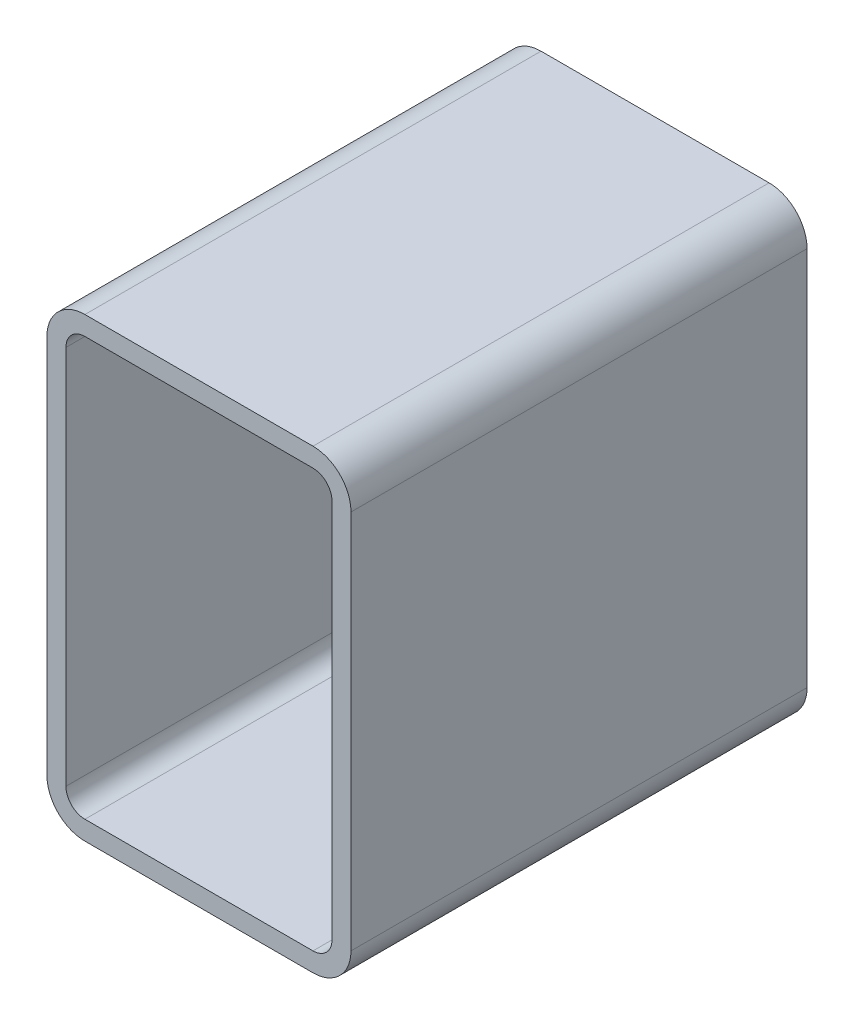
ISO-10303-21;
HEADER;
FILE_DESCRIPTION(('STEP AP214'),'2;1');
FILE_NAME('part.step','',(''),(''),'','','');
FILE_SCHEMA(('AUTOMOTIVE_DESIGN { 1 0 10303 214 1 1 1 1 }'));
ENDSEC;
DATA;
#1=APPLICATION_CONTEXT('core data for automotive mechanical design processes');
#2=APPLICATION_PROTOCOL_DEFINITION('international standard','automotive_design',2000,#1);
#3=PRODUCT_CONTEXT('',#1,'mechanical');
#4=PRODUCT('Part','Part','',(#3));
#5=PRODUCT_RELATED_PRODUCT_CATEGORY('part','',(#4));
#6=PRODUCT_DEFINITION_FORMATION('','',#4);
#7=PRODUCT_DEFINITION_CONTEXT('part definition',#1,'design');
#8=PRODUCT_DEFINITION('design','',#6,#7);
#9=PRODUCT_DEFINITION_SHAPE('','',#8);
#10=(LENGTH_UNIT() NAMED_UNIT(*) SI_UNIT(.MILLI.,.METRE.));
#11=(NAMED_UNIT(*) PLANE_ANGLE_UNIT() SI_UNIT($,.RADIAN.));
#12=(NAMED_UNIT(*) SI_UNIT($,.STERADIAN.) SOLID_ANGLE_UNIT());
#13=UNCERTAINTY_MEASURE_WITH_UNIT(LENGTH_MEASURE(1.E-05),#10,'distance_accuracy_value','');
#14=(GEOMETRIC_REPRESENTATION_CONTEXT(3) GLOBAL_UNCERTAINTY_ASSIGNED_CONTEXT((#13)) GLOBAL_UNIT_ASSIGNED_CONTEXT((#10,
#11,#12)) REPRESENTATION_CONTEXT('',''));
#15=CARTESIAN_POINT('',(0.,0.,0.));
#16=DIRECTION('',(0.,0.,1.));
#17=DIRECTION('',(1.,0.,0.));
#18=AXIS2_PLACEMENT_3D('',#15,#16,#17);
#19=CARTESIAN_POINT('',(26.7909404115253,281.274496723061,304.8));
#20=DIRECTION('',(0.,0.,1.));
#21=DIRECTION('',(1.,0.,0.));
#22=AXIS2_PLACEMENT_3D('',#19,#20,#21);
#23=PLANE('',#22);
#24=CARTESIAN_POINT('',(26.7909404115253,281.274496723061,304.8));
#25=DIRECTION('',(0.,0.,1.));
#26=DIRECTION('',(1.,0.,0.));
#27=AXIS2_PLACEMENT_3D('',#24,#25,#26);
#28=CIRCLE('',#27,25.4);
#29=CARTESIAN_POINT('',(26.7909404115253,306.674496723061,304.8));
#30=VERTEX_POINT('',#29);
#31=CARTESIAN_POINT('',(1.3909404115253,281.274496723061,304.8));
#32=VERTEX_POINT('',#31);
#33=EDGE_CURVE('E211',#30,#32,#28,.T.);
#34=ORIENTED_EDGE('',*,*,#33,.T.);
#35=DIRECTION('',(0.,-1.,0.));
#36=VECTOR('',#35,1.);
#37=CARTESIAN_POINT('',(1.3909404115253,27.2744967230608,304.8));
#38=LINE('',#37,#36);
#39=CARTESIAN_POINT('',(1.3909404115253,27.2744967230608,304.8));
#40=VERTEX_POINT('',#39);
#41=EDGE_CURVE('E214',#32,#40,#38,.T.);
#42=ORIENTED_EDGE('',*,*,#41,.T.);
#43=CARTESIAN_POINT('',(26.7909404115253,27.2744967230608,304.8));
#44=DIRECTION('',(0.,0.,1.));
#45=DIRECTION('',(1.,0.,0.));
#46=AXIS2_PLACEMENT_3D('',#43,#44,#45);
#47=CIRCLE('',#46,25.4);
#48=CARTESIAN_POINT('',(26.7909404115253,1.87449672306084,304.8));
#49=VERTEX_POINT('',#48);
#50=EDGE_CURVE('E217',#40,#49,#47,.T.);
#51=ORIENTED_EDGE('',*,*,#50,.T.);
#52=DIRECTION('',(1.,0.,0.));
#53=VECTOR('',#52,1.);
#54=CARTESIAN_POINT('',(179.190940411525,1.87449672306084,304.8));
#55=LINE('',#54,#53);
#56=CARTESIAN_POINT('',(179.190940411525,1.87449672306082,304.8));
#57=VERTEX_POINT('',#56);
#58=EDGE_CURVE('E219',#49,#57,#55,.T.);
#59=ORIENTED_EDGE('',*,*,#58,.T.);
#60=CARTESIAN_POINT('',(179.190940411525,27.2744967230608,304.8));
#61=DIRECTION('',(0.,0.,1.));
#62=DIRECTION('',(1.,0.,0.));
#63=AXIS2_PLACEMENT_3D('',#60,#61,#62);
#64=CIRCLE('',#63,25.4);
#65=CARTESIAN_POINT('',(204.590940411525,27.2744967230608,304.8));
#66=VERTEX_POINT('',#65);
#67=EDGE_CURVE('E221',#57,#66,#64,.T.);
#68=ORIENTED_EDGE('',*,*,#67,.T.);
#69=DIRECTION('',(0.,1.,0.));
#70=VECTOR('',#69,1.);
#71=CARTESIAN_POINT('',(204.590940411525,281.274496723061,304.8));
#72=LINE('',#71,#70);
#73=CARTESIAN_POINT('',(204.590940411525,281.274496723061,304.8));
#74=VERTEX_POINT('',#73);
#75=EDGE_CURVE('E223',#66,#74,#72,.T.);
#76=ORIENTED_EDGE('',*,*,#75,.T.);
#77=CARTESIAN_POINT('',(179.190940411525,281.274496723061,304.8));
#78=DIRECTION('',(0.,0.,1.));
#79=DIRECTION('',(1.,0.,0.));
#80=AXIS2_PLACEMENT_3D('',#77,#78,#79);
#81=CIRCLE('',#80,25.4);
#82=CARTESIAN_POINT('',(179.190940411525,306.674496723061,304.8));
#83=VERTEX_POINT('',#82);
#84=EDGE_CURVE('E225',#74,#83,#81,.T.);
#85=ORIENTED_EDGE('',*,*,#84,.T.);
#86=DIRECTION('',(-1.,0.,0.));
#87=VECTOR('',#86,1.);
#88=CARTESIAN_POINT('',(26.7909404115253,306.674496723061,304.8));
#89=LINE('',#88,#87);
#90=EDGE_CURVE('E227',#83,#30,#89,.T.);
#91=ORIENTED_EDGE('',*,*,#90,.T.);
#92=EDGE_LOOP('',(#34,#42,#51,#59,#68,#76,#85,#91));
#93=FACE_BOUND('',#92,.T.);
#94=DIRECTION('',(0.,-1.,0.));
#95=VECTOR('',#94,1.);
#96=CARTESIAN_POINT('',(14.0909404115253,27.2744967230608,304.8));
#97=LINE('',#96,#95);
#98=CARTESIAN_POINT('',(14.0909404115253,281.274496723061,304.8));
#99=VERTEX_POINT('',#98);
#100=CARTESIAN_POINT('',(14.0909404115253,27.2744967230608,304.8));
#101=VERTEX_POINT('',#100);
#102=EDGE_CURVE('E154',#99,#101,#97,.T.);
#103=ORIENTED_EDGE('',*,*,#102,.F.);
#104=CARTESIAN_POINT('',(26.7909404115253,281.274496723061,304.8));
#105=DIRECTION('',(0.,0.,1.));
#106=DIRECTION('',(1.,0.,0.));
#107=AXIS2_PLACEMENT_3D('',#104,#105,#106);
#108=CIRCLE('',#107,12.7);
#109=CARTESIAN_POINT('',(26.7909404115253,293.974496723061,304.8));
#110=VERTEX_POINT('',#109);
#111=EDGE_CURVE('E146',#110,#99,#108,.T.);
#112=ORIENTED_EDGE('',*,*,#111,.F.);
#113=DIRECTION('',(-1.,0.,0.));
#114=VECTOR('',#113,1.);
#115=CARTESIAN_POINT('',(26.7909404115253,293.974496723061,304.8));
#116=LINE('',#115,#114);
#117=CARTESIAN_POINT('',(179.190940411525,293.974496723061,304.8));
#118=VERTEX_POINT('',#117);
#119=EDGE_CURVE('E179',#118,#110,#116,.T.);
#120=ORIENTED_EDGE('',*,*,#119,.F.);
#121=CARTESIAN_POINT('',(179.190940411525,281.274496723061,304.8));
#122=DIRECTION('',(0.,0.,1.));
#123=DIRECTION('',(1.,0.,0.));
#124=AXIS2_PLACEMENT_3D('',#121,#122,#123);
#125=CIRCLE('',#124,12.7);
#126=CARTESIAN_POINT('',(191.890940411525,281.274496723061,304.8));
#127=VERTEX_POINT('',#126);
#128=EDGE_CURVE('E177',#127,#118,#125,.T.);
#129=ORIENTED_EDGE('',*,*,#128,.F.);
#130=DIRECTION('',(0.,1.,0.));
#131=VECTOR('',#130,1.);
#132=CARTESIAN_POINT('',(191.890940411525,281.274496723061,304.8));
#133=LINE('',#132,#131);
#134=CARTESIAN_POINT('',(191.890940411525,27.2744967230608,304.8));
#135=VERTEX_POINT('',#134);
#136=EDGE_CURVE('E175',#135,#127,#133,.T.);
#137=ORIENTED_EDGE('',*,*,#136,.F.);
#138=CARTESIAN_POINT('',(179.190940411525,27.2744967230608,304.8));
#139=DIRECTION('',(0.,0.,1.));
#140=DIRECTION('',(1.,0.,0.));
#141=AXIS2_PLACEMENT_3D('',#138,#139,#140);
#142=CIRCLE('',#141,12.7);
#143=CARTESIAN_POINT('',(179.190940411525,14.5744967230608,304.8));
#144=VERTEX_POINT('',#143);
#145=EDGE_CURVE('E173',#144,#135,#142,.T.);
#146=ORIENTED_EDGE('',*,*,#145,.F.);
#147=DIRECTION('',(1.,0.,0.));
#148=VECTOR('',#147,1.);
#149=CARTESIAN_POINT('',(179.190940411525,14.5744967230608,304.8));
#150=LINE('',#149,#148);
#151=CARTESIAN_POINT('',(26.7909404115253,14.5744967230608,304.8));
#152=VERTEX_POINT('',#151);
#153=EDGE_CURVE('E169',#152,#144,#150,.T.);
#154=ORIENTED_EDGE('',*,*,#153,.F.);
#155=CARTESIAN_POINT('',(26.7909404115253,27.2744967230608,304.8));
#156=DIRECTION('',(0.,0.,1.));
#157=DIRECTION('',(1.,0.,0.));
#158=AXIS2_PLACEMENT_3D('',#155,#156,#157);
#159=CIRCLE('',#158,12.7);
#160=EDGE_CURVE('E167',#101,#152,#159,.T.);
#161=ORIENTED_EDGE('',*,*,#160,.F.);
#162=EDGE_LOOP('',(#103,#112,#120,#129,#137,#146,#154,#161));
#163=FACE_BOUND('',#162,.T.);
#164=ADVANCED_FACE('F33',(#93,#163),#23,.T.);
#165=CARTESIAN_POINT('',(26.7909404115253,281.274496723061,0.));
#166=DIRECTION('',(0.,0.,1.));
#167=DIRECTION('',(1.,0.,0.));
#168=AXIS2_PLACEMENT_3D('',#165,#166,#167);
#169=PLANE('',#168);
#170=CARTESIAN_POINT('',(26.7909404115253,281.274496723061,0.));
#171=DIRECTION('',(0.,0.,1.));
#172=DIRECTION('',(1.,0.,0.));
#173=AXIS2_PLACEMENT_3D('',#170,#171,#172);
#174=CIRCLE('',#173,25.4);
#175=CARTESIAN_POINT('',(26.7909404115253,306.674496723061,0.));
#176=VERTEX_POINT('',#175);
#177=CARTESIAN_POINT('',(1.3909404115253,281.274496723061,0.));
#178=VERTEX_POINT('',#177);
#179=EDGE_CURVE('E162',#176,#178,#174,.T.);
#180=ORIENTED_EDGE('',*,*,#179,.F.);
#181=DIRECTION('',(-1.,0.,0.));
#182=VECTOR('',#181,1.);
#183=CARTESIAN_POINT('',(26.7909404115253,306.674496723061,0.));
#184=LINE('',#183,#182);
#185=CARTESIAN_POINT('',(179.190940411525,306.674496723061,0.));
#186=VERTEX_POINT('',#185);
#187=EDGE_CURVE('E215',#186,#176,#184,.T.);
#188=ORIENTED_EDGE('',*,*,#187,.F.);
#189=CARTESIAN_POINT('',(179.190940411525,281.274496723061,0.));
#190=DIRECTION('',(0.,0.,1.));
#191=DIRECTION('',(1.,0.,0.));
#192=AXIS2_PLACEMENT_3D('',#189,#190,#191);
#193=CIRCLE('',#192,25.4);
#194=CARTESIAN_POINT('',(204.590940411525,281.274496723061,0.));
#195=VERTEX_POINT('',#194);
#196=EDGE_CURVE('E242',#195,#186,#193,.T.);
#197=ORIENTED_EDGE('',*,*,#196,.F.);
#198=DIRECTION('',(0.,1.,0.));
#199=VECTOR('',#198,1.);
#200=CARTESIAN_POINT('',(204.590940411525,281.274496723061,0.));
#201=LINE('',#200,#199);
#202=CARTESIAN_POINT('',(204.590940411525,27.2744967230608,0.));
#203=VERTEX_POINT('',#202);
#204=EDGE_CURVE('E240',#203,#195,#201,.T.);
#205=ORIENTED_EDGE('',*,*,#204,.F.);
#206=CARTESIAN_POINT('',(179.190940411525,27.2744967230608,0.));
#207=DIRECTION('',(0.,0.,1.));
#208=DIRECTION('',(1.,0.,0.));
#209=AXIS2_PLACEMENT_3D('',#206,#207,#208);
#210=CIRCLE('',#209,25.4);
#211=CARTESIAN_POINT('',(179.190940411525,1.87449672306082,0.));
#212=VERTEX_POINT('',#211);
#213=EDGE_CURVE('E238',#212,#203,#210,.T.);
#214=ORIENTED_EDGE('',*,*,#213,.F.);
#215=DIRECTION('',(1.,0.,0.));
#216=VECTOR('',#215,1.);
#217=CARTESIAN_POINT('',(179.190940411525,1.87449672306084,0.));
#218=LINE('',#217,#216);
#219=CARTESIAN_POINT('',(26.7909404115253,1.87449672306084,0.));
#220=VERTEX_POINT('',#219);
#221=EDGE_CURVE('E236',#220,#212,#218,.T.);
#222=ORIENTED_EDGE('',*,*,#221,.F.);
#223=CARTESIAN_POINT('',(26.7909404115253,27.2744967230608,0.));
#224=DIRECTION('',(0.,0.,1.));
#225=DIRECTION('',(1.,0.,0.));
#226=AXIS2_PLACEMENT_3D('',#223,#224,#225);
#227=CIRCLE('',#226,25.4);
#228=CARTESIAN_POINT('',(1.3909404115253,27.2744967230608,0.));
#229=VERTEX_POINT('',#228);
#230=EDGE_CURVE('E234',#229,#220,#227,.T.);
#231=ORIENTED_EDGE('',*,*,#230,.F.);
#232=DIRECTION('',(0.,-1.,0.));
#233=VECTOR('',#232,1.);
#234=CARTESIAN_POINT('',(1.3909404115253,27.2744967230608,0.));
#235=LINE('',#234,#233);
#236=EDGE_CURVE('E232',#178,#229,#235,.T.);
#237=ORIENTED_EDGE('',*,*,#236,.F.);
#238=EDGE_LOOP('',(#180,#188,#197,#205,#214,#222,#231,#237));
#239=FACE_BOUND('',#238,.T.);
#240=CARTESIAN_POINT('',(26.7909404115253,281.274496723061,0.));
#241=DIRECTION('',(0.,0.,1.));
#242=DIRECTION('',(1.,0.,0.));
#243=AXIS2_PLACEMENT_3D('',#240,#241,#242);
#244=CIRCLE('',#243,12.7);
#245=CARTESIAN_POINT('',(26.7909404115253,293.974496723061,0.));
#246=VERTEX_POINT('',#245);
#247=CARTESIAN_POINT('',(14.0909404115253,281.274496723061,0.));
#248=VERTEX_POINT('',#247);
#249=EDGE_CURVE('E56',#246,#248,#244,.T.);
#250=ORIENTED_EDGE('',*,*,#249,.T.);
#251=DIRECTION('',(0.,-1.,0.));
#252=VECTOR('',#251,1.);
#253=CARTESIAN_POINT('',(14.0909404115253,27.2744967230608,0.));
#254=LINE('',#253,#252);
#255=CARTESIAN_POINT('',(14.0909404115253,27.2744967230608,0.));
#256=VERTEX_POINT('',#255);
#257=EDGE_CURVE('E161',#248,#256,#254,.T.);
#258=ORIENTED_EDGE('',*,*,#257,.T.);
#259=CARTESIAN_POINT('',(26.7909404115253,27.2744967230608,0.));
#260=DIRECTION('',(0.,0.,1.));
#261=DIRECTION('',(1.,0.,0.));
#262=AXIS2_PLACEMENT_3D('',#259,#260,#261);
#263=CIRCLE('',#262,12.7);
#264=CARTESIAN_POINT('',(26.7909404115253,14.5744967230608,0.));
#265=VERTEX_POINT('',#264);
#266=EDGE_CURVE('E183',#256,#265,#263,.T.);
#267=ORIENTED_EDGE('',*,*,#266,.T.);
#268=DIRECTION('',(1.,0.,0.));
#269=VECTOR('',#268,1.);
#270=CARTESIAN_POINT('',(179.190940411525,14.5744967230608,0.));
#271=LINE('',#270,#269);
#272=CARTESIAN_POINT('',(179.190940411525,14.5744967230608,0.));
#273=VERTEX_POINT('',#272);
#274=EDGE_CURVE('E186',#265,#273,#271,.T.);
#275=ORIENTED_EDGE('',*,*,#274,.T.);
#276=CARTESIAN_POINT('',(179.190940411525,27.2744967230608,0.));
#277=DIRECTION('',(0.,0.,1.));
#278=DIRECTION('',(1.,0.,0.));
#279=AXIS2_PLACEMENT_3D('',#276,#277,#278);
#280=CIRCLE('',#279,12.7);
#281=CARTESIAN_POINT('',(191.890940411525,27.2744967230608,0.));
#282=VERTEX_POINT('',#281);
#283=EDGE_CURVE('E189',#273,#282,#280,.T.);
#284=ORIENTED_EDGE('',*,*,#283,.T.);
#285=DIRECTION('',(0.,1.,0.));
#286=VECTOR('',#285,1.);
#287=CARTESIAN_POINT('',(191.890940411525,281.274496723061,0.));
#288=LINE('',#287,#286);
#289=CARTESIAN_POINT('',(191.890940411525,281.274496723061,0.));
#290=VERTEX_POINT('',#289);
#291=EDGE_CURVE('E192',#282,#290,#288,.T.);
#292=ORIENTED_EDGE('',*,*,#291,.T.);
#293=CARTESIAN_POINT('',(179.190940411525,281.274496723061,0.));
#294=DIRECTION('',(0.,0.,1.));
#295=DIRECTION('',(1.,0.,0.));
#296=AXIS2_PLACEMENT_3D('',#293,#294,#295);
#297=CIRCLE('',#296,12.7);
#298=CARTESIAN_POINT('',(179.190940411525,293.974496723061,0.));
#299=VERTEX_POINT('',#298);
#300=EDGE_CURVE('E195',#290,#299,#297,.T.);
#301=ORIENTED_EDGE('',*,*,#300,.T.);
#302=DIRECTION('',(-1.,0.,0.));
#303=VECTOR('',#302,1.);
#304=CARTESIAN_POINT('',(26.7909404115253,293.974496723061,0.));
#305=LINE('',#304,#303);
#306=EDGE_CURVE('E155',#299,#246,#305,.T.);
#307=ORIENTED_EDGE('',*,*,#306,.T.);
#308=EDGE_LOOP('',(#250,#258,#267,#275,#284,#292,#301,#307));
#309=FACE_BOUND('',#308,.T.);
#310=ADVANCED_FACE('F272',(#239,#309),#169,.F.);
#311=CARTESIAN_POINT('',(26.7909404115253,281.274496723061,304.8));
#312=DIRECTION('',(0.,0.,-1.));
#313=DIRECTION('',(-1.,0.,0.));
#314=AXIS2_PLACEMENT_3D('',#311,#312,#313);
#315=CYLINDRICAL_SURFACE('',#314,25.4);
#316=ORIENTED_EDGE('',*,*,#179,.T.);
#317=DIRECTION('',(0.,0.,-1.));
#318=VECTOR('',#317,1.);
#319=CARTESIAN_POINT('',(1.3909404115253,281.274496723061,304.8));
#320=LINE('',#319,#318);
#321=EDGE_CURVE('E11',#32,#178,#320,.T.);
#322=ORIENTED_EDGE('',*,*,#321,.F.);
#323=ORIENTED_EDGE('',*,*,#33,.F.);
#324=DIRECTION('',(0.,0.,-1.));
#325=VECTOR('',#324,1.);
#326=CARTESIAN_POINT('',(26.7909404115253,306.674496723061,304.8));
#327=LINE('',#326,#325);
#328=EDGE_CURVE('E229',#30,#176,#327,.T.);
#329=ORIENTED_EDGE('',*,*,#328,.T.);
#330=EDGE_LOOP('',(#316,#322,#323,#329));
#331=FACE_BOUND('',#330,.T.);
#332=ADVANCED_FACE('F35',(#331),#315,.T.);
#333=CARTESIAN_POINT('',(1.3909404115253,27.2744967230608,304.8));
#334=DIRECTION('',(1.,0.,0.));
#335=DIRECTION('',(0.,0.,-1.));
#336=AXIS2_PLACEMENT_3D('',#333,#334,#335);
#337=PLANE('',#336);
#338=ORIENTED_EDGE('',*,*,#236,.T.);
#339=DIRECTION('',(0.,0.,-1.));
#340=VECTOR('',#339,1.);
#341=CARTESIAN_POINT('',(1.3909404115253,27.2744967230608,304.8));
#342=LINE('',#341,#340);
#343=EDGE_CURVE('E41',#40,#229,#342,.T.);
#344=ORIENTED_EDGE('',*,*,#343,.F.);
#345=ORIENTED_EDGE('',*,*,#41,.F.);
#346=ORIENTED_EDGE('',*,*,#321,.T.);
#347=EDGE_LOOP('',(#338,#344,#345,#346));
#348=FACE_BOUND('',#347,.T.);
#349=ADVANCED_FACE('F289',(#348),#337,.F.);
#350=CARTESIAN_POINT('',(26.7909404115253,27.2744967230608,304.8));
#351=DIRECTION('',(0.,0.,-1.));
#352=DIRECTION('',(-1.,0.,0.));
#353=AXIS2_PLACEMENT_3D('',#350,#351,#352);
#354=CYLINDRICAL_SURFACE('',#353,25.4);
#355=ORIENTED_EDGE('',*,*,#230,.T.);
#356=DIRECTION('',(0.,0.,-1.));
#357=VECTOR('',#356,1.);
#358=CARTESIAN_POINT('',(26.7909404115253,1.87449672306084,304.8));
#359=LINE('',#358,#357);
#360=EDGE_CURVE('E259',#49,#220,#359,.T.);
#361=ORIENTED_EDGE('',*,*,#360,.F.);
#362=ORIENTED_EDGE('',*,*,#50,.F.);
#363=ORIENTED_EDGE('',*,*,#343,.T.);
#364=EDGE_LOOP('',(#355,#361,#362,#363));
#365=FACE_BOUND('',#364,.T.);
#366=ADVANCED_FACE('F266',(#365),#354,.T.);
#367=CARTESIAN_POINT('',(179.190940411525,1.87449672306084,304.8));
#368=DIRECTION('',(0.,1.,0.));
#369=DIRECTION('',(0.,0.,1.));
#370=AXIS2_PLACEMENT_3D('',#367,#368,#369);
#371=PLANE('',#370);
#372=ORIENTED_EDGE('',*,*,#221,.T.);
#373=DIRECTION('',(0.,0.,-1.));
#374=VECTOR('',#373,1.);
#375=CARTESIAN_POINT('',(179.190940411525,1.87449672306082,304.8));
#376=LINE('',#375,#374);
#377=EDGE_CURVE('E256',#57,#212,#376,.T.);
#378=ORIENTED_EDGE('',*,*,#377,.F.);
#379=ORIENTED_EDGE('',*,*,#58,.F.);
#380=ORIENTED_EDGE('',*,*,#360,.T.);
#381=EDGE_LOOP('',(#372,#378,#379,#380));
#382=FACE_BOUND('',#381,.T.);
#383=ADVANCED_FACE('F278',(#382),#371,.F.);
#384=CARTESIAN_POINT('',(179.190940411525,27.2744967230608,304.8));
#385=DIRECTION('',(0.,0.,-1.));
#386=DIRECTION('',(-1.,0.,0.));
#387=AXIS2_PLACEMENT_3D('',#384,#385,#386);
#388=CYLINDRICAL_SURFACE('',#387,25.4);
#389=ORIENTED_EDGE('',*,*,#213,.T.);
#390=DIRECTION('',(0.,0.,-1.));
#391=VECTOR('',#390,1.);
#392=CARTESIAN_POINT('',(204.590940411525,27.2744967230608,304.8));
#393=LINE('',#392,#391);
#394=EDGE_CURVE('E253',#66,#203,#393,.T.);
#395=ORIENTED_EDGE('',*,*,#394,.F.);
#396=ORIENTED_EDGE('',*,*,#67,.F.);
#397=ORIENTED_EDGE('',*,*,#377,.T.);
#398=EDGE_LOOP('',(#389,#395,#396,#397));
#399=FACE_BOUND('',#398,.T.);
#400=ADVANCED_FACE('F282',(#399),#388,.T.);
#401=CARTESIAN_POINT('',(204.590940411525,281.274496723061,304.8));
#402=DIRECTION('',(-1.,0.,0.));
#403=DIRECTION('',(0.,0.,1.));
#404=AXIS2_PLACEMENT_3D('',#401,#402,#403);
#405=PLANE('',#404);
#406=ORIENTED_EDGE('',*,*,#204,.T.);
#407=DIRECTION('',(0.,0.,-1.));
#408=VECTOR('',#407,1.);
#409=CARTESIAN_POINT('',(204.590940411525,281.274496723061,304.8));
#410=LINE('',#409,#408);
#411=EDGE_CURVE('E250',#74,#195,#410,.T.);
#412=ORIENTED_EDGE('',*,*,#411,.F.);
#413=ORIENTED_EDGE('',*,*,#75,.F.);
#414=ORIENTED_EDGE('',*,*,#394,.T.);
#415=EDGE_LOOP('',(#406,#412,#413,#414));
#416=FACE_BOUND('',#415,.T.);
#417=ADVANCED_FACE('F302',(#416),#405,.F.);
#418=CARTESIAN_POINT('',(179.190940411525,281.274496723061,304.8));
#419=DIRECTION('',(0.,0.,-1.));
#420=DIRECTION('',(-1.,0.,0.));
#421=AXIS2_PLACEMENT_3D('',#418,#419,#420);
#422=CYLINDRICAL_SURFACE('',#421,25.4);
#423=ORIENTED_EDGE('',*,*,#196,.T.);
#424=DIRECTION('',(0.,0.,-1.));
#425=VECTOR('',#424,1.);
#426=CARTESIAN_POINT('',(179.190940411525,306.674496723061,304.8));
#427=LINE('',#426,#425);
#428=EDGE_CURVE('E247',#83,#186,#427,.T.);
#429=ORIENTED_EDGE('',*,*,#428,.F.);
#430=ORIENTED_EDGE('',*,*,#84,.F.);
#431=ORIENTED_EDGE('',*,*,#411,.T.);
#432=EDGE_LOOP('',(#423,#429,#430,#431));
#433=FACE_BOUND('',#432,.T.);
#434=ADVANCED_FACE('F300',(#433),#422,.T.);
#435=CARTESIAN_POINT('',(26.7909404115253,306.674496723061,304.8));
#436=DIRECTION('',(0.,-1.,0.));
#437=DIRECTION('',(0.,0.,-1.));
#438=AXIS2_PLACEMENT_3D('',#435,#436,#437);
#439=PLANE('',#438);
#440=ORIENTED_EDGE('',*,*,#187,.T.);
#441=ORIENTED_EDGE('',*,*,#328,.F.);
#442=ORIENTED_EDGE('',*,*,#90,.F.);
#443=ORIENTED_EDGE('',*,*,#428,.T.);
#444=EDGE_LOOP('',(#440,#441,#442,#443));
#445=FACE_BOUND('',#444,.T.);
#446=ADVANCED_FACE('F295',(#445),#439,.F.);
#447=CARTESIAN_POINT('',(26.7909404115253,281.274496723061,304.8));
#448=DIRECTION('',(0.,0.,-1.));
#449=DIRECTION('',(-1.,0.,0.));
#450=AXIS2_PLACEMENT_3D('',#447,#448,#449);
#451=CYLINDRICAL_SURFACE('',#450,12.7);
#452=ORIENTED_EDGE('',*,*,#249,.F.);
#453=DIRECTION('',(0.,0.,-1.));
#454=VECTOR('',#453,1.);
#455=CARTESIAN_POINT('',(26.7909404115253,293.974496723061,304.8));
#456=LINE('',#455,#454);
#457=EDGE_CURVE('E150',#110,#246,#456,.T.);
#458=ORIENTED_EDGE('',*,*,#457,.F.);
#459=ORIENTED_EDGE('',*,*,#111,.T.);
#460=DIRECTION('',(0.,0.,-1.));
#461=VECTOR('',#460,1.);
#462=CARTESIAN_POINT('',(14.0909404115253,281.274496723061,304.8));
#463=LINE('',#462,#461);
#464=EDGE_CURVE('E149',#99,#248,#463,.T.);
#465=ORIENTED_EDGE('',*,*,#464,.T.);
#466=EDGE_LOOP('',(#452,#458,#459,#465));
#467=FACE_BOUND('',#466,.T.);
#468=ADVANCED_FACE('F148',(#467),#451,.F.);
#469=CARTESIAN_POINT('',(14.0909404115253,27.2744967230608,304.8));
#470=DIRECTION('',(1.,0.,0.));
#471=DIRECTION('',(0.,0.,-1.));
#472=AXIS2_PLACEMENT_3D('',#469,#470,#471);
#473=PLANE('',#472);
#474=ORIENTED_EDGE('',*,*,#257,.F.);
#475=ORIENTED_EDGE('',*,*,#464,.F.);
#476=ORIENTED_EDGE('',*,*,#102,.T.);
#477=DIRECTION('',(0.,0.,-1.));
#478=VECTOR('',#477,1.);
#479=CARTESIAN_POINT('',(14.0909404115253,27.2744967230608,304.8));
#480=LINE('',#479,#478);
#481=EDGE_CURVE('E163',#101,#256,#480,.T.);
#482=ORIENTED_EDGE('',*,*,#481,.T.);
#483=EDGE_LOOP('',(#474,#475,#476,#482));
#484=FACE_BOUND('',#483,.T.);
#485=ADVANCED_FACE('F158',(#484),#473,.T.);
#486=CARTESIAN_POINT('',(26.7909404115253,27.2744967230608,304.8));
#487=DIRECTION('',(0.,0.,-1.));
#488=DIRECTION('',(-1.,0.,0.));
#489=AXIS2_PLACEMENT_3D('',#486,#487,#488);
#490=CYLINDRICAL_SURFACE('',#489,12.7);
#491=ORIENTED_EDGE('',*,*,#266,.F.);
#492=ORIENTED_EDGE('',*,*,#481,.F.);
#493=ORIENTED_EDGE('',*,*,#160,.T.);
#494=DIRECTION('',(0.,0.,-1.));
#495=VECTOR('',#494,1.);
#496=CARTESIAN_POINT('',(26.7909404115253,14.5744967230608,304.8));
#497=LINE('',#496,#495);
#498=EDGE_CURVE('E208',#152,#265,#497,.T.);
#499=ORIENTED_EDGE('',*,*,#498,.T.);
#500=EDGE_LOOP('',(#491,#492,#493,#499));
#501=FACE_BOUND('',#500,.T.);
#502=ADVANCED_FACE('F327',(#501),#490,.F.);
#503=CARTESIAN_POINT('',(179.190940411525,14.5744967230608,304.8));
#504=DIRECTION('',(0.,1.,0.));
#505=DIRECTION('',(0.,0.,1.));
#506=AXIS2_PLACEMENT_3D('',#503,#504,#505);
#507=PLANE('',#506);
#508=ORIENTED_EDGE('',*,*,#274,.F.);
#509=ORIENTED_EDGE('',*,*,#498,.F.);
#510=ORIENTED_EDGE('',*,*,#153,.T.);
#511=DIRECTION('',(0.,0.,-1.));
#512=VECTOR('',#511,1.);
#513=CARTESIAN_POINT('',(179.190940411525,14.5744967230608,304.8));
#514=LINE('',#513,#512);
#515=EDGE_CURVE('E206',#144,#273,#514,.T.);
#516=ORIENTED_EDGE('',*,*,#515,.T.);
#517=EDGE_LOOP('',(#508,#509,#510,#516));
#518=FACE_BOUND('',#517,.T.);
#519=ADVANCED_FACE('F331',(#518),#507,.T.);
#520=CARTESIAN_POINT('',(179.190940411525,27.2744967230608,304.8));
#521=DIRECTION('',(0.,0.,-1.));
#522=DIRECTION('',(-1.,0.,0.));
#523=AXIS2_PLACEMENT_3D('',#520,#521,#522);
#524=CYLINDRICAL_SURFACE('',#523,12.7);
#525=ORIENTED_EDGE('',*,*,#283,.F.);
#526=ORIENTED_EDGE('',*,*,#515,.F.);
#527=ORIENTED_EDGE('',*,*,#145,.T.);
#528=DIRECTION('',(0.,0.,-1.));
#529=VECTOR('',#528,1.);
#530=CARTESIAN_POINT('',(191.890940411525,27.2744967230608,304.8));
#531=LINE('',#530,#529);
#532=EDGE_CURVE('E204',#135,#282,#531,.T.);
#533=ORIENTED_EDGE('',*,*,#532,.T.);
#534=EDGE_LOOP('',(#525,#526,#527,#533));
#535=FACE_BOUND('',#534,.T.);
#536=ADVANCED_FACE('F337',(#535),#524,.F.);
#537=CARTESIAN_POINT('',(191.890940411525,281.274496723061,304.8));
#538=DIRECTION('',(-1.,0.,0.));
#539=DIRECTION('',(0.,0.,1.));
#540=AXIS2_PLACEMENT_3D('',#537,#538,#539);
#541=PLANE('',#540);
#542=ORIENTED_EDGE('',*,*,#291,.F.);
#543=ORIENTED_EDGE('',*,*,#532,.F.);
#544=ORIENTED_EDGE('',*,*,#136,.T.);
#545=DIRECTION('',(0.,0.,-1.));
#546=VECTOR('',#545,1.);
#547=CARTESIAN_POINT('',(191.890940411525,281.274496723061,304.8));
#548=LINE('',#547,#546);
#549=EDGE_CURVE('E202',#127,#290,#548,.T.);
#550=ORIENTED_EDGE('',*,*,#549,.T.);
#551=EDGE_LOOP('',(#542,#543,#544,#550));
#552=FACE_BOUND('',#551,.T.);
#553=ADVANCED_FACE('F341',(#552),#541,.T.);
#554=CARTESIAN_POINT('',(179.190940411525,281.274496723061,304.8));
#555=DIRECTION('',(0.,0.,-1.));
#556=DIRECTION('',(-1.,0.,0.));
#557=AXIS2_PLACEMENT_3D('',#554,#555,#556);
#558=CYLINDRICAL_SURFACE('',#557,12.7);
#559=ORIENTED_EDGE('',*,*,#300,.F.);
#560=ORIENTED_EDGE('',*,*,#549,.F.);
#561=ORIENTED_EDGE('',*,*,#128,.T.);
#562=DIRECTION('',(0.,0.,-1.));
#563=VECTOR('',#562,1.);
#564=CARTESIAN_POINT('',(179.190940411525,293.974496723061,304.8));
#565=LINE('',#564,#563);
#566=EDGE_CURVE('E48',#118,#299,#565,.T.);
#567=ORIENTED_EDGE('',*,*,#566,.T.);
#568=EDGE_LOOP('',(#559,#560,#561,#567));
#569=FACE_BOUND('',#568,.T.);
#570=ADVANCED_FACE('F345',(#569),#558,.F.);
#571=CARTESIAN_POINT('',(26.7909404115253,293.974496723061,304.8));
#572=DIRECTION('',(0.,-1.,0.));
#573=DIRECTION('',(0.,0.,-1.));
#574=AXIS2_PLACEMENT_3D('',#571,#572,#573);
#575=PLANE('',#574);
#576=ORIENTED_EDGE('',*,*,#306,.F.);
#577=ORIENTED_EDGE('',*,*,#566,.F.);
#578=ORIENTED_EDGE('',*,*,#119,.T.);
#579=ORIENTED_EDGE('',*,*,#457,.T.);
#580=EDGE_LOOP('',(#576,#577,#578,#579));
#581=FACE_BOUND('',#580,.T.);
#582=ADVANCED_FACE('F349',(#581),#575,.T.);
#583=CLOSED_SHELL('',(#164,#310,#332,#349,#366,#383,#400,#417,#434,#446,#468,#485,#502,#519,
#536,#553,#570,#582));
#584=MANIFOLD_SOLID_BREP('B2',#583);
#585=ADVANCED_BREP_SHAPE_REPRESENTATION('',(#18,#584),#14);
#586=SHAPE_DEFINITION_REPRESENTATION(#9,#585);
ENDSEC;
END-ISO-10303-21;
